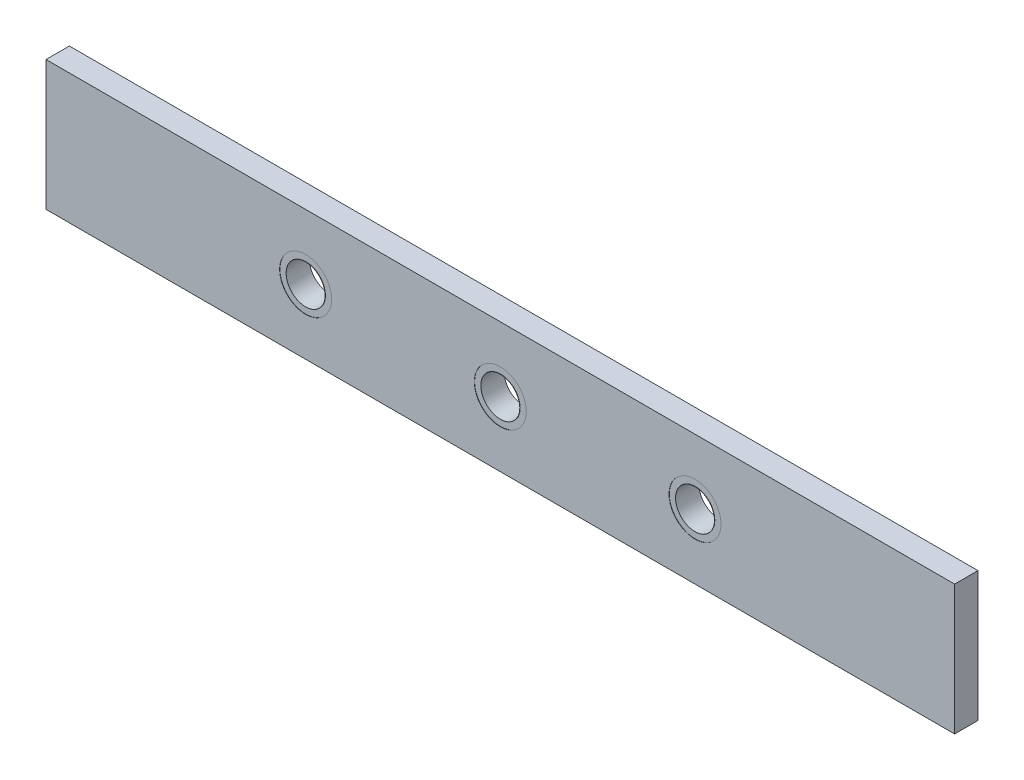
ISO-10303-21;
HEADER;
FILE_DESCRIPTION(('STEP AP214'),'2;1');
FILE_NAME('part.step','',(''),(''),'','','');
FILE_SCHEMA(('AUTOMOTIVE_DESIGN { 1 0 10303 214 1 1 1 1 }'));
ENDSEC;
DATA;
#1=APPLICATION_CONTEXT('core data for automotive mechanical design processes');
#2=APPLICATION_PROTOCOL_DEFINITION('international standard','automotive_design',2000,#1);
#3=PRODUCT_CONTEXT('',#1,'mechanical');
#4=PRODUCT('Part','Part','',(#3));
#5=PRODUCT_RELATED_PRODUCT_CATEGORY('part','',(#4));
#6=PRODUCT_DEFINITION_FORMATION('','',#4);
#7=PRODUCT_DEFINITION_CONTEXT('part definition',#1,'design');
#8=PRODUCT_DEFINITION('design','',#6,#7);
#9=PRODUCT_DEFINITION_SHAPE('','',#8);
#10=(LENGTH_UNIT() NAMED_UNIT(*) SI_UNIT(.MILLI.,.METRE.));
#11=(NAMED_UNIT(*) PLANE_ANGLE_UNIT() SI_UNIT($,.RADIAN.));
#12=(NAMED_UNIT(*) SI_UNIT($,.STERADIAN.) SOLID_ANGLE_UNIT());
#13=UNCERTAINTY_MEASURE_WITH_UNIT(LENGTH_MEASURE(1.E-05),#10,'distance_accuracy_value','');
#14=(GEOMETRIC_REPRESENTATION_CONTEXT(3) GLOBAL_UNCERTAINTY_ASSIGNED_CONTEXT((#13)) GLOBAL_UNIT_ASSIGNED_CONTEXT((#10,
#11,#12)) REPRESENTATION_CONTEXT('',''));
#15=CARTESIAN_POINT('',(0.,0.,0.));
#16=DIRECTION('',(0.,0.,1.));
#17=DIRECTION('',(1.,0.,0.));
#18=AXIS2_PLACEMENT_3D('',#15,#16,#17);
#19=CARTESIAN_POINT('',(0.,0.,0.));
#20=DIRECTION('',(0.,0.,1.));
#21=DIRECTION('',(1.,0.,0.));
#22=AXIS2_PLACEMENT_3D('',#19,#20,#21);
#23=PLANE('',#22);
#24=DIRECTION('',(0.,1.,0.));
#25=VECTOR('',#24,1.);
#26=CARTESIAN_POINT('',(350.,50.,0.));
#27=LINE('',#26,#25);
#28=CARTESIAN_POINT('',(350.,-50.,0.));
#29=VERTEX_POINT('',#28);
#30=CARTESIAN_POINT('',(350.,50.,0.));
#31=VERTEX_POINT('',#30);
#32=EDGE_CURVE('E96',#29,#31,#27,.T.);
#33=ORIENTED_EDGE('',*,*,#32,.F.);
#34=DIRECTION('',(1.,0.,0.));
#35=VECTOR('',#34,1.);
#36=CARTESIAN_POINT('',(-350.,-50.,0.));
#37=LINE('',#36,#35);
#38=CARTESIAN_POINT('',(-350.,-50.,0.));
#39=VERTEX_POINT('',#38);
#40=EDGE_CURVE('E72',#39,#29,#37,.T.);
#41=ORIENTED_EDGE('',*,*,#40,.F.);
#42=DIRECTION('',(0.,-1.,0.));
#43=VECTOR('',#42,1.);
#44=CARTESIAN_POINT('',(-350.,50.,0.));
#45=LINE('',#44,#43);
#46=CARTESIAN_POINT('',(-350.,50.,0.));
#47=VERTEX_POINT('',#46);
#48=EDGE_CURVE('E66',#47,#39,#45,.T.);
#49=ORIENTED_EDGE('',*,*,#48,.F.);
#50=DIRECTION('',(-1.,0.,0.));
#51=VECTOR('',#50,1.);
#52=CARTESIAN_POINT('',(-350.,50.,0.));
#53=LINE('',#52,#51);
#54=EDGE_CURVE('E88',#31,#47,#53,.T.);
#55=ORIENTED_EDGE('',*,*,#54,.F.);
#56=EDGE_LOOP('',(#33,#41,#49,#55));
#57=FACE_BOUND('',#56,.T.);
#58=CARTESIAN_POINT('',(150.,0.,0.));
#59=DIRECTION('',(0.,0.,1.));
#60=DIRECTION('',(1.,0.,0.));
#61=AXIS2_PLACEMENT_3D('',#58,#59,#60);
#62=CIRCLE('',#61,20.);
#63=CARTESIAN_POINT('',(170.,0.,0.));
#64=VERTEX_POINT('',#63);
#65=EDGE_CURVE('E164',#64,#64,#62,.T.);
#66=ORIENTED_EDGE('',*,*,#65,.T.);
#67=EDGE_LOOP('',(#66));
#68=FACE_BOUND('',#67,.T.);
#69=CARTESIAN_POINT('',(0.,0.,0.));
#70=DIRECTION('',(0.,0.,1.));
#71=DIRECTION('',(1.,0.,0.));
#72=AXIS2_PLACEMENT_3D('',#69,#70,#71);
#73=CIRCLE('',#72,20.);
#74=CARTESIAN_POINT('',(20.,0.,0.));
#75=VERTEX_POINT('',#74);
#76=EDGE_CURVE('E176',#75,#75,#73,.T.);
#77=ORIENTED_EDGE('',*,*,#76,.T.);
#78=EDGE_LOOP('',(#77));
#79=FACE_BOUND('',#78,.T.);
#80=CARTESIAN_POINT('',(-150.,0.,0.));
#81=DIRECTION('',(0.,0.,1.));
#82=DIRECTION('',(1.,0.,0.));
#83=AXIS2_PLACEMENT_3D('',#80,#81,#82);
#84=CIRCLE('',#83,20.);
#85=CARTESIAN_POINT('',(-130.,0.,0.));
#86=VERTEX_POINT('',#85);
#87=EDGE_CURVE('E188',#86,#86,#84,.T.);
#88=ORIENTED_EDGE('',*,*,#87,.T.);
#89=EDGE_LOOP('',(#88));
#90=FACE_BOUND('',#89,.T.);
#91=ADVANCED_FACE('F32',(#57,#68,#79,#90),#23,.F.);
#92=CARTESIAN_POINT('',(-150.,0.,0.));
#93=DIRECTION('',(0.,0.,1.));
#94=DIRECTION('',(1.,0.,0.));
#95=AXIS2_PLACEMENT_3D('',#92,#93,#94);
#96=CIRCLE('',#95,15.05);
#97=CARTESIAN_POINT('',(-134.95,0.,0.));
#98=VERTEX_POINT('',#97);
#99=EDGE_CURVE('E194',#98,#98,#96,.T.);
#100=ORIENTED_EDGE('',*,*,#99,.F.);
#101=EDGE_LOOP('',(#100));
#102=FACE_BOUND('',#101,.T.);
#103=CARTESIAN_POINT('',(-150.,0.,0.));
#104=DIRECTION('',(0.,0.,1.));
#105=DIRECTION('',(-1.,0.,0.));
#106=AXIS2_PLACEMENT_3D('',#103,#104,#105);
#107=CIRCLE('',#106,15.);
#108=CARTESIAN_POINT('',(-165.,0.,0.));
#109=VERTEX_POINT('',#108);
#110=EDGE_CURVE('E113',#109,#109,#107,.T.);
#111=ORIENTED_EDGE('',*,*,#110,.T.);
#112=EDGE_LOOP('',(#111));
#113=FACE_BOUND('',#112,.T.);
#114=ADVANCED_FACE('F209',(#102,#113),#23,.F.);
#115=CARTESIAN_POINT('',(0.,0.,0.));
#116=DIRECTION('',(0.,0.,1.));
#117=DIRECTION('',(1.,0.,0.));
#118=AXIS2_PLACEMENT_3D('',#115,#116,#117);
#119=CIRCLE('',#118,15.05);
#120=CARTESIAN_POINT('',(15.05,0.,0.));
#121=VERTEX_POINT('',#120);
#122=EDGE_CURVE('E182',#121,#121,#119,.T.);
#123=ORIENTED_EDGE('',*,*,#122,.F.);
#124=EDGE_LOOP('',(#123));
#125=FACE_BOUND('',#124,.T.);
#126=CARTESIAN_POINT('',(0.,0.,0.));
#127=DIRECTION('',(0.,0.,1.));
#128=DIRECTION('',(1.,0.,0.));
#129=AXIS2_PLACEMENT_3D('',#126,#127,#128);
#130=CIRCLE('',#129,15.);
#131=CARTESIAN_POINT('',(15.,0.,0.));
#132=VERTEX_POINT('',#131);
#133=EDGE_CURVE('E119',#132,#132,#130,.T.);
#134=ORIENTED_EDGE('',*,*,#133,.T.);
#135=EDGE_LOOP('',(#134));
#136=FACE_BOUND('',#135,.T.);
#137=ADVANCED_FACE('F212',(#125,#136),#23,.F.);
#138=CARTESIAN_POINT('',(0.,0.,18.));
#139=DIRECTION('',(0.,0.,1.));
#140=DIRECTION('',(1.,0.,0.));
#141=AXIS2_PLACEMENT_3D('',#138,#139,#140);
#142=PLANE('',#141);
#143=CARTESIAN_POINT('',(-150.,0.,18.));
#144=DIRECTION('',(0.,0.,1.));
#145=DIRECTION('',(-1.,0.,0.));
#146=AXIS2_PLACEMENT_3D('',#143,#144,#145);
#147=CIRCLE('',#146,15.);
#148=CARTESIAN_POINT('',(-165.,0.,18.));
#149=VERTEX_POINT('',#148);
#150=EDGE_CURVE('E116',#149,#149,#147,.T.);
#151=ORIENTED_EDGE('',*,*,#150,.F.);
#152=EDGE_LOOP('',(#151));
#153=FACE_BOUND('',#152,.T.);
#154=CARTESIAN_POINT('',(-150.,0.,18.));
#155=DIRECTION('',(0.,0.,1.));
#156=DIRECTION('',(1.,0.,0.));
#157=AXIS2_PLACEMENT_3D('',#154,#155,#156);
#158=CIRCLE('',#157,15.05);
#159=CARTESIAN_POINT('',(-134.95,0.,18.));
#160=VERTEX_POINT('',#159);
#161=EDGE_CURVE('E158',#160,#160,#158,.T.);
#162=ORIENTED_EDGE('',*,*,#161,.T.);
#163=EDGE_LOOP('',(#162));
#164=FACE_BOUND('',#163,.T.);
#165=ADVANCED_FACE('F224',(#153,#164),#142,.T.);
#166=CARTESIAN_POINT('',(0.,0.,18.));
#167=DIRECTION('',(0.,0.,1.));
#168=DIRECTION('',(1.,0.,0.));
#169=AXIS2_PLACEMENT_3D('',#166,#167,#168);
#170=CIRCLE('',#169,15.);
#171=CARTESIAN_POINT('',(15.,0.,18.));
#172=VERTEX_POINT('',#171);
#173=EDGE_CURVE('E122',#172,#172,#170,.T.);
#174=ORIENTED_EDGE('',*,*,#173,.F.);
#175=EDGE_LOOP('',(#174));
#176=FACE_BOUND('',#175,.T.);
#177=CARTESIAN_POINT('',(0.,0.,18.));
#178=DIRECTION('',(0.,0.,1.));
#179=DIRECTION('',(1.,0.,0.));
#180=AXIS2_PLACEMENT_3D('',#177,#178,#179);
#181=CIRCLE('',#180,15.05);
#182=CARTESIAN_POINT('',(15.05,0.,18.));
#183=VERTEX_POINT('',#182);
#184=EDGE_CURVE('E146',#183,#183,#181,.T.);
#185=ORIENTED_EDGE('',*,*,#184,.T.);
#186=EDGE_LOOP('',(#185));
#187=FACE_BOUND('',#186,.T.);
#188=ADVANCED_FACE('F227',(#176,#187),#142,.T.);
#189=CARTESIAN_POINT('',(150.,0.,18.));
#190=DIRECTION('',(0.,0.,1.));
#191=DIRECTION('',(1.,0.,0.));
#192=AXIS2_PLACEMENT_3D('',#189,#190,#191);
#193=CIRCLE('',#192,15.);
#194=CARTESIAN_POINT('',(165.,0.,18.));
#195=VERTEX_POINT('',#194);
#196=EDGE_CURVE('E110',#195,#195,#193,.T.);
#197=ORIENTED_EDGE('',*,*,#196,.F.);
#198=EDGE_LOOP('',(#197));
#199=FACE_BOUND('',#198,.T.);
#200=CARTESIAN_POINT('',(150.,0.,18.));
#201=DIRECTION('',(0.,0.,1.));
#202=DIRECTION('',(1.,0.,0.));
#203=AXIS2_PLACEMENT_3D('',#200,#201,#202);
#204=CIRCLE('',#203,15.05);
#205=CARTESIAN_POINT('',(165.05,0.,18.));
#206=VERTEX_POINT('',#205);
#207=EDGE_CURVE('E134',#206,#206,#204,.T.);
#208=ORIENTED_EDGE('',*,*,#207,.T.);
#209=EDGE_LOOP('',(#208));
#210=FACE_BOUND('',#209,.T.);
#211=ADVANCED_FACE('F262',(#199,#210),#142,.T.);
#212=CARTESIAN_POINT('',(350.,50.,18.));
#213=DIRECTION('',(-1.,0.,0.));
#214=DIRECTION('',(0.,0.,1.));
#215=AXIS2_PLACEMENT_3D('',#212,#213,#214);
#216=PLANE('',#215);
#217=ORIENTED_EDGE('',*,*,#32,.T.);
#218=DIRECTION('',(0.,0.,-1.));
#219=VECTOR('',#218,1.);
#220=CARTESIAN_POINT('',(350.,50.,18.));
#221=LINE('',#220,#219);
#222=CARTESIAN_POINT('',(350.,50.,18.));
#223=VERTEX_POINT('',#222);
#224=EDGE_CURVE('E11',#223,#31,#221,.T.);
#225=ORIENTED_EDGE('',*,*,#224,.F.);
#226=DIRECTION('',(0.,1.,0.));
#227=VECTOR('',#226,1.);
#228=CARTESIAN_POINT('',(350.,50.,18.));
#229=LINE('',#228,#227);
#230=CARTESIAN_POINT('',(350.,-50.,18.));
#231=VERTEX_POINT('',#230);
#232=EDGE_CURVE('E84',#231,#223,#229,.T.);
#233=ORIENTED_EDGE('',*,*,#232,.F.);
#234=DIRECTION('',(0.,0.,-1.));
#235=VECTOR('',#234,1.);
#236=CARTESIAN_POINT('',(350.,-50.,18.));
#237=LINE('',#236,#235);
#238=EDGE_CURVE('E92',#231,#29,#237,.T.);
#239=ORIENTED_EDGE('',*,*,#238,.T.);
#240=EDGE_LOOP('',(#217,#225,#233,#239));
#241=FACE_BOUND('',#240,.T.);
#242=ADVANCED_FACE('F34',(#241),#216,.F.);
#243=CARTESIAN_POINT('',(-350.,50.,18.));
#244=DIRECTION('',(0.,-1.,0.));
#245=DIRECTION('',(0.,0.,-1.));
#246=AXIS2_PLACEMENT_3D('',#243,#244,#245);
#247=PLANE('',#246);
#248=ORIENTED_EDGE('',*,*,#54,.T.);
#249=DIRECTION('',(0.,0.,-1.));
#250=VECTOR('',#249,1.);
#251=CARTESIAN_POINT('',(-350.,50.,18.));
#252=LINE('',#251,#250);
#253=CARTESIAN_POINT('',(-350.,50.,18.));
#254=VERTEX_POINT('',#253);
#255=EDGE_CURVE('E41',#254,#47,#252,.T.);
#256=ORIENTED_EDGE('',*,*,#255,.F.);
#257=DIRECTION('',(-1.,0.,0.));
#258=VECTOR('',#257,1.);
#259=CARTESIAN_POINT('',(-350.,50.,18.));
#260=LINE('',#259,#258);
#261=EDGE_CURVE('E79',#223,#254,#260,.T.);
#262=ORIENTED_EDGE('',*,*,#261,.F.);
#263=ORIENTED_EDGE('',*,*,#224,.T.);
#264=EDGE_LOOP('',(#248,#256,#262,#263));
#265=FACE_BOUND('',#264,.T.);
#266=ADVANCED_FACE('F87',(#265),#247,.F.);
#267=CARTESIAN_POINT('',(-350.,50.,18.));
#268=DIRECTION('',(1.,0.,0.));
#269=DIRECTION('',(0.,0.,-1.));
#270=AXIS2_PLACEMENT_3D('',#267,#268,#269);
#271=PLANE('',#270);
#272=ORIENTED_EDGE('',*,*,#48,.T.);
#273=DIRECTION('',(0.,0.,-1.));
#274=VECTOR('',#273,1.);
#275=CARTESIAN_POINT('',(-350.,-50.,18.));
#276=LINE('',#275,#274);
#277=CARTESIAN_POINT('',(-350.,-50.,18.));
#278=VERTEX_POINT('',#277);
#279=EDGE_CURVE('E89',#278,#39,#276,.T.);
#280=ORIENTED_EDGE('',*,*,#279,.F.);
#281=DIRECTION('',(0.,-1.,0.));
#282=VECTOR('',#281,1.);
#283=CARTESIAN_POINT('',(-350.,50.,18.));
#284=LINE('',#283,#282);
#285=EDGE_CURVE('E82',#254,#278,#284,.T.);
#286=ORIENTED_EDGE('',*,*,#285,.F.);
#287=ORIENTED_EDGE('',*,*,#255,.T.);
#288=EDGE_LOOP('',(#272,#280,#286,#287));
#289=FACE_BOUND('',#288,.T.);
#290=ADVANCED_FACE('F90',(#289),#271,.F.);
#291=CARTESIAN_POINT('',(-350.,-50.,18.));
#292=DIRECTION('',(0.,1.,0.));
#293=DIRECTION('',(0.,0.,1.));
#294=AXIS2_PLACEMENT_3D('',#291,#292,#293);
#295=PLANE('',#294);
#296=ORIENTED_EDGE('',*,*,#40,.T.);
#297=ORIENTED_EDGE('',*,*,#238,.F.);
#298=DIRECTION('',(1.,0.,0.));
#299=VECTOR('',#298,1.);
#300=CARTESIAN_POINT('',(-350.,-50.,18.));
#301=LINE('',#300,#299);
#302=EDGE_CURVE('E49',#278,#231,#301,.T.);
#303=ORIENTED_EDGE('',*,*,#302,.F.);
#304=ORIENTED_EDGE('',*,*,#279,.T.);
#305=EDGE_LOOP('',(#296,#297,#303,#304));
#306=FACE_BOUND('',#305,.T.);
#307=ADVANCED_FACE('F104',(#306),#295,.F.);
#308=CARTESIAN_POINT('',(-150.,0.,18.));
#309=DIRECTION('',(0.,0.,1.));
#310=DIRECTION('',(1.,0.,0.));
#311=AXIS2_PLACEMENT_3D('',#308,#309,#310);
#312=CIRCLE('',#311,20.);
#313=CARTESIAN_POINT('',(-130.,0.,18.));
#314=VERTEX_POINT('',#313);
#315=EDGE_CURVE('E152',#314,#314,#312,.T.);
#316=ORIENTED_EDGE('',*,*,#315,.F.);
#317=EDGE_LOOP('',(#316));
#318=FACE_BOUND('',#317,.T.);
#319=CARTESIAN_POINT('',(0.,0.,18.));
#320=DIRECTION('',(0.,0.,1.));
#321=DIRECTION('',(1.,0.,0.));
#322=AXIS2_PLACEMENT_3D('',#319,#320,#321);
#323=CIRCLE('',#322,20.);
#324=CARTESIAN_POINT('',(20.,0.,18.));
#325=VERTEX_POINT('',#324);
#326=EDGE_CURVE('E140',#325,#325,#323,.T.);
#327=ORIENTED_EDGE('',*,*,#326,.F.);
#328=EDGE_LOOP('',(#327));
#329=FACE_BOUND('',#328,.T.);
#330=CARTESIAN_POINT('',(150.,0.,18.));
#331=DIRECTION('',(0.,0.,1.));
#332=DIRECTION('',(1.,0.,0.));
#333=AXIS2_PLACEMENT_3D('',#330,#331,#332);
#334=CIRCLE('',#333,20.);
#335=CARTESIAN_POINT('',(170.,0.,18.));
#336=VERTEX_POINT('',#335);
#337=EDGE_CURVE('E128',#336,#336,#334,.T.);
#338=ORIENTED_EDGE('',*,*,#337,.F.);
#339=EDGE_LOOP('',(#338));
#340=FACE_BOUND('',#339,.T.);
#341=ORIENTED_EDGE('',*,*,#232,.T.);
#342=ORIENTED_EDGE('',*,*,#261,.T.);
#343=ORIENTED_EDGE('',*,*,#285,.T.);
#344=ORIENTED_EDGE('',*,*,#302,.T.);
#345=EDGE_LOOP('',(#341,#342,#343,#344));
#346=FACE_BOUND('',#345,.T.);
#347=ADVANCED_FACE('F80',(#318,#329,#340,#346),#142,.T.);
#348=CARTESIAN_POINT('',(150.,0.,0.));
#349=DIRECTION('',(0.,0.,1.));
#350=DIRECTION('',(1.,0.,0.));
#351=AXIS2_PLACEMENT_3D('',#348,#349,#350);
#352=CIRCLE('',#351,15.05);
#353=CARTESIAN_POINT('',(165.05,0.,0.));
#354=VERTEX_POINT('',#353);
#355=EDGE_CURVE('E170',#354,#354,#352,.T.);
#356=ORIENTED_EDGE('',*,*,#355,.F.);
#357=EDGE_LOOP('',(#356));
#358=FACE_BOUND('',#357,.T.);
#359=CARTESIAN_POINT('',(150.,0.,0.));
#360=DIRECTION('',(0.,0.,1.));
#361=DIRECTION('',(1.,0.,0.));
#362=AXIS2_PLACEMENT_3D('',#359,#360,#361);
#363=CIRCLE('',#362,15.);
#364=CARTESIAN_POINT('',(165.,0.,0.));
#365=VERTEX_POINT('',#364);
#366=EDGE_CURVE('E99',#365,#365,#363,.T.);
#367=ORIENTED_EDGE('',*,*,#366,.T.);
#368=EDGE_LOOP('',(#367));
#369=FACE_BOUND('',#368,.T.);
#370=ADVANCED_FACE('F249',(#358,#369),#23,.F.);
#371=CARTESIAN_POINT('',(150.,0.,0.));
#372=DIRECTION('',(0.,0.,1.));
#373=DIRECTION('',(1.,0.,0.));
#374=AXIS2_PLACEMENT_3D('',#371,#372,#373);
#375=CYLINDRICAL_SURFACE('',#374,15.);
#376=ORIENTED_EDGE('',*,*,#366,.F.);
#377=EDGE_LOOP('',(#376));
#378=FACE_BOUND('',#377,.T.);
#379=ORIENTED_EDGE('',*,*,#196,.T.);
#380=EDGE_LOOP('',(#379));
#381=FACE_BOUND('',#380,.T.);
#382=ADVANCED_FACE('F220',(#378,#381),#375,.F.);
#383=CARTESIAN_POINT('',(-150.,0.,0.));
#384=DIRECTION('',(0.,0.,1.));
#385=DIRECTION('',(1.,0.,0.));
#386=AXIS2_PLACEMENT_3D('',#383,#384,#385);
#387=CYLINDRICAL_SURFACE('',#386,15.);
#388=ORIENTED_EDGE('',*,*,#110,.F.);
#389=EDGE_LOOP('',(#388));
#390=FACE_BOUND('',#389,.T.);
#391=ORIENTED_EDGE('',*,*,#150,.T.);
#392=EDGE_LOOP('',(#391));
#393=FACE_BOUND('',#392,.T.);
#394=ADVANCED_FACE('F216',(#390,#393),#387,.F.);
#395=CARTESIAN_POINT('',(0.,0.,0.));
#396=DIRECTION('',(0.,0.,1.));
#397=DIRECTION('',(1.,0.,0.));
#398=AXIS2_PLACEMENT_3D('',#395,#396,#397);
#399=CYLINDRICAL_SURFACE('',#398,15.);
#400=ORIENTED_EDGE('',*,*,#133,.F.);
#401=EDGE_LOOP('',(#400));
#402=FACE_BOUND('',#401,.T.);
#403=ORIENTED_EDGE('',*,*,#173,.T.);
#404=EDGE_LOOP('',(#403));
#405=FACE_BOUND('',#404,.T.);
#406=ADVANCED_FACE('F219',(#402,#405),#399,.F.);
#407=CARTESIAN_POINT('',(150.,0.,17.8));
#408=DIRECTION('',(0.,0.,1.));
#409=DIRECTION('',(1.,0.,0.));
#410=AXIS2_PLACEMENT_3D('',#407,#408,#409);
#411=CYLINDRICAL_SURFACE('',#410,20.);
#412=CARTESIAN_POINT('',(150.,0.,17.8));
#413=DIRECTION('',(0.,0.,1.));
#414=DIRECTION('',(1.,0.,0.));
#415=AXIS2_PLACEMENT_3D('',#412,#413,#414);
#416=CIRCLE('',#415,20.);
#417=CARTESIAN_POINT('',(170.,0.,17.8));
#418=VERTEX_POINT('',#417);
#419=EDGE_CURVE('E125',#418,#418,#416,.T.);
#420=ORIENTED_EDGE('',*,*,#419,.F.);
#421=EDGE_LOOP('',(#420));
#422=FACE_BOUND('',#421,.T.);
#423=ORIENTED_EDGE('',*,*,#337,.T.);
#424=EDGE_LOOP('',(#423));
#425=FACE_BOUND('',#424,.T.);
#426=ADVANCED_FACE('F275',(#422,#425),#411,.F.);
#427=CARTESIAN_POINT('',(150.,0.,17.8));
#428=DIRECTION('',(0.,0.,1.));
#429=DIRECTION('',(1.,0.,0.));
#430=AXIS2_PLACEMENT_3D('',#427,#428,#429);
#431=PLANE('',#430);
#432=CARTESIAN_POINT('',(150.,0.,17.8));
#433=DIRECTION('',(0.,0.,1.));
#434=DIRECTION('',(1.,0.,0.));
#435=AXIS2_PLACEMENT_3D('',#432,#433,#434);
#436=CIRCLE('',#435,15.05);
#437=CARTESIAN_POINT('',(165.05,0.,17.8));
#438=VERTEX_POINT('',#437);
#439=EDGE_CURVE('E131',#438,#438,#436,.T.);
#440=ORIENTED_EDGE('',*,*,#439,.F.);
#441=EDGE_LOOP('',(#440));
#442=FACE_BOUND('',#441,.T.);
#443=ORIENTED_EDGE('',*,*,#419,.T.);
#444=EDGE_LOOP('',(#443));
#445=FACE_BOUND('',#444,.T.);
#446=ADVANCED_FACE('F304',(#442,#445),#431,.T.);
#447=CARTESIAN_POINT('',(150.,0.,17.8));
#448=DIRECTION('',(0.,0.,1.));
#449=DIRECTION('',(1.,0.,0.));
#450=AXIS2_PLACEMENT_3D('',#447,#448,#449);
#451=CYLINDRICAL_SURFACE('',#450,15.05);
#452=ORIENTED_EDGE('',*,*,#439,.T.);
#453=EDGE_LOOP('',(#452));
#454=FACE_BOUND('',#453,.T.);
#455=ORIENTED_EDGE('',*,*,#207,.F.);
#456=EDGE_LOOP('',(#455));
#457=FACE_BOUND('',#456,.T.);
#458=ADVANCED_FACE('F300',(#454,#457),#451,.T.);
#459=CARTESIAN_POINT('',(0.,0.,17.8));
#460=DIRECTION('',(0.,0.,1.));
#461=DIRECTION('',(1.,0.,0.));
#462=AXIS2_PLACEMENT_3D('',#459,#460,#461);
#463=CYLINDRICAL_SURFACE('',#462,20.);
#464=CARTESIAN_POINT('',(0.,0.,17.8));
#465=DIRECTION('',(0.,0.,1.));
#466=DIRECTION('',(1.,0.,0.));
#467=AXIS2_PLACEMENT_3D('',#464,#465,#466);
#468=CIRCLE('',#467,20.);
#469=CARTESIAN_POINT('',(20.,0.,17.8));
#470=VERTEX_POINT('',#469);
#471=EDGE_CURVE('E137',#470,#470,#468,.T.);
#472=ORIENTED_EDGE('',*,*,#471,.F.);
#473=EDGE_LOOP('',(#472));
#474=FACE_BOUND('',#473,.T.);
#475=ORIENTED_EDGE('',*,*,#326,.T.);
#476=EDGE_LOOP('',(#475));
#477=FACE_BOUND('',#476,.T.);
#478=ADVANCED_FACE('F294',(#474,#477),#463,.F.);
#479=CARTESIAN_POINT('',(0.,0.,17.8));
#480=DIRECTION('',(0.,0.,1.));
#481=DIRECTION('',(1.,0.,0.));
#482=AXIS2_PLACEMENT_3D('',#479,#480,#481);
#483=PLANE('',#482);
#484=CARTESIAN_POINT('',(0.,0.,17.8));
#485=DIRECTION('',(0.,0.,1.));
#486=DIRECTION('',(1.,0.,0.));
#487=AXIS2_PLACEMENT_3D('',#484,#485,#486);
#488=CIRCLE('',#487,15.05);
#489=CARTESIAN_POINT('',(15.05,0.,17.8));
#490=VERTEX_POINT('',#489);
#491=EDGE_CURVE('E143',#490,#490,#488,.T.);
#492=ORIENTED_EDGE('',*,*,#491,.F.);
#493=EDGE_LOOP('',(#492));
#494=FACE_BOUND('',#493,.T.);
#495=ORIENTED_EDGE('',*,*,#471,.T.);
#496=EDGE_LOOP('',(#495));
#497=FACE_BOUND('',#496,.T.);
#498=ADVANCED_FACE('F285',(#494,#497),#483,.T.);
#499=CARTESIAN_POINT('',(0.,0.,17.8));
#500=DIRECTION('',(0.,0.,1.));
#501=DIRECTION('',(1.,0.,0.));
#502=AXIS2_PLACEMENT_3D('',#499,#500,#501);
#503=CYLINDRICAL_SURFACE('',#502,15.05);
#504=ORIENTED_EDGE('',*,*,#491,.T.);
#505=EDGE_LOOP('',(#504));
#506=FACE_BOUND('',#505,.T.);
#507=ORIENTED_EDGE('',*,*,#184,.F.);
#508=EDGE_LOOP('',(#507));
#509=FACE_BOUND('',#508,.T.);
#510=ADVANCED_FACE('F283',(#506,#509),#503,.T.);
#511=CARTESIAN_POINT('',(-150.,0.,17.8));
#512=DIRECTION('',(0.,0.,1.));
#513=DIRECTION('',(1.,0.,0.));
#514=AXIS2_PLACEMENT_3D('',#511,#512,#513);
#515=CYLINDRICAL_SURFACE('',#514,20.);
#516=CARTESIAN_POINT('',(-150.,0.,17.8));
#517=DIRECTION('',(0.,0.,1.));
#518=DIRECTION('',(1.,0.,0.));
#519=AXIS2_PLACEMENT_3D('',#516,#517,#518);
#520=CIRCLE('',#519,20.);
#521=CARTESIAN_POINT('',(-130.,0.,17.8));
#522=VERTEX_POINT('',#521);
#523=EDGE_CURVE('E149',#522,#522,#520,.T.);
#524=ORIENTED_EDGE('',*,*,#523,.F.);
#525=EDGE_LOOP('',(#524));
#526=FACE_BOUND('',#525,.T.);
#527=ORIENTED_EDGE('',*,*,#315,.T.);
#528=EDGE_LOOP('',(#527));
#529=FACE_BOUND('',#528,.T.);
#530=ADVANCED_FACE('F244',(#526,#529),#515,.F.);
#531=CARTESIAN_POINT('',(-150.,0.,17.8));
#532=DIRECTION('',(0.,0.,1.));
#533=DIRECTION('',(1.,0.,0.));
#534=AXIS2_PLACEMENT_3D('',#531,#532,#533);
#535=PLANE('',#534);
#536=CARTESIAN_POINT('',(-150.,0.,17.8));
#537=DIRECTION('',(0.,0.,1.));
#538=DIRECTION('',(1.,0.,0.));
#539=AXIS2_PLACEMENT_3D('',#536,#537,#538);
#540=CIRCLE('',#539,15.05);
#541=CARTESIAN_POINT('',(-134.95,0.,17.8));
#542=VERTEX_POINT('',#541);
#543=EDGE_CURVE('E155',#542,#542,#540,.T.);
#544=ORIENTED_EDGE('',*,*,#543,.F.);
#545=EDGE_LOOP('',(#544));
#546=FACE_BOUND('',#545,.T.);
#547=ORIENTED_EDGE('',*,*,#523,.T.);
#548=EDGE_LOOP('',(#547));
#549=FACE_BOUND('',#548,.T.);
#550=ADVANCED_FACE('F234',(#546,#549),#535,.T.);
#551=CARTESIAN_POINT('',(-150.,0.,17.8));
#552=DIRECTION('',(0.,0.,1.));
#553=DIRECTION('',(1.,0.,0.));
#554=AXIS2_PLACEMENT_3D('',#551,#552,#553);
#555=CYLINDRICAL_SURFACE('',#554,15.05);
#556=ORIENTED_EDGE('',*,*,#543,.T.);
#557=EDGE_LOOP('',(#556));
#558=FACE_BOUND('',#557,.T.);
#559=ORIENTED_EDGE('',*,*,#161,.F.);
#560=EDGE_LOOP('',(#559));
#561=FACE_BOUND('',#560,.T.);
#562=ADVANCED_FACE('F231',(#558,#561),#555,.T.);
#563=CARTESIAN_POINT('',(150.,0.,0.2));
#564=DIRECTION('',(0.,0.,-1.));
#565=DIRECTION('',(1.,0.,0.));
#566=AXIS2_PLACEMENT_3D('',#563,#564,#565);
#567=PLANE('',#566);
#568=CARTESIAN_POINT('',(150.,0.,0.2));
#569=DIRECTION('',(0.,0.,1.));
#570=DIRECTION('',(1.,0.,0.));
#571=AXIS2_PLACEMENT_3D('',#568,#569,#570);
#572=CIRCLE('',#571,20.);
#573=CARTESIAN_POINT('',(170.,0.,0.2));
#574=VERTEX_POINT('',#573);
#575=EDGE_CURVE('E161',#574,#574,#572,.T.);
#576=ORIENTED_EDGE('',*,*,#575,.F.);
#577=EDGE_LOOP('',(#576));
#578=FACE_BOUND('',#577,.T.);
#579=CARTESIAN_POINT('',(150.,0.,0.2));
#580=DIRECTION('',(0.,0.,1.));
#581=DIRECTION('',(1.,0.,0.));
#582=AXIS2_PLACEMENT_3D('',#579,#580,#581);
#583=CIRCLE('',#582,15.05);
#584=CARTESIAN_POINT('',(165.05,0.,0.2));
#585=VERTEX_POINT('',#584);
#586=EDGE_CURVE('E167',#585,#585,#583,.T.);
#587=ORIENTED_EDGE('',*,*,#586,.T.);
#588=EDGE_LOOP('',(#587));
#589=FACE_BOUND('',#588,.T.);
#590=ADVANCED_FACE('F233',(#578,#589),#567,.T.);
#591=CARTESIAN_POINT('',(150.,0.,0.2));
#592=DIRECTION('',(0.,0.,-1.));
#593=DIRECTION('',(-1.,0.,0.));
#594=AXIS2_PLACEMENT_3D('',#591,#592,#593);
#595=CYLINDRICAL_SURFACE('',#594,20.);
#596=ORIENTED_EDGE('',*,*,#575,.T.);
#597=EDGE_LOOP('',(#596));
#598=FACE_BOUND('',#597,.T.);
#599=ORIENTED_EDGE('',*,*,#65,.F.);
#600=EDGE_LOOP('',(#599));
#601=FACE_BOUND('',#600,.T.);
#602=ADVANCED_FACE('F241',(#598,#601),#595,.F.);
#603=CARTESIAN_POINT('',(150.,0.,0.2));
#604=DIRECTION('',(0.,0.,-1.));
#605=DIRECTION('',(-1.,0.,0.));
#606=AXIS2_PLACEMENT_3D('',#603,#604,#605);
#607=CYLINDRICAL_SURFACE('',#606,15.05);
#608=ORIENTED_EDGE('',*,*,#586,.F.);
#609=EDGE_LOOP('',(#608));
#610=FACE_BOUND('',#609,.T.);
#611=ORIENTED_EDGE('',*,*,#355,.T.);
#612=EDGE_LOOP('',(#611));
#613=FACE_BOUND('',#612,.T.);
#614=ADVANCED_FACE('F392',(#610,#613),#607,.T.);
#615=CARTESIAN_POINT('',(0.,0.,0.2));
#616=DIRECTION('',(0.,0.,-1.));
#617=DIRECTION('',(1.,0.,0.));
#618=AXIS2_PLACEMENT_3D('',#615,#616,#617);
#619=PLANE('',#618);
#620=CARTESIAN_POINT('',(0.,0.,0.2));
#621=DIRECTION('',(0.,0.,1.));
#622=DIRECTION('',(1.,0.,0.));
#623=AXIS2_PLACEMENT_3D('',#620,#621,#622);
#624=CIRCLE('',#623,20.);
#625=CARTESIAN_POINT('',(20.,0.,0.2));
#626=VERTEX_POINT('',#625);
#627=EDGE_CURVE('E173',#626,#626,#624,.T.);
#628=ORIENTED_EDGE('',*,*,#627,.F.);
#629=EDGE_LOOP('',(#628));
#630=FACE_BOUND('',#629,.T.);
#631=CARTESIAN_POINT('',(0.,0.,0.2));
#632=DIRECTION('',(0.,0.,1.));
#633=DIRECTION('',(1.,0.,0.));
#634=AXIS2_PLACEMENT_3D('',#631,#632,#633);
#635=CIRCLE('',#634,15.05);
#636=CARTESIAN_POINT('',(15.05,0.,0.2));
#637=VERTEX_POINT('',#636);
#638=EDGE_CURVE('E179',#637,#637,#635,.T.);
#639=ORIENTED_EDGE('',*,*,#638,.T.);
#640=EDGE_LOOP('',(#639));
#641=FACE_BOUND('',#640,.T.);
#642=ADVANCED_FACE('F401',(#630,#641),#619,.T.);
#643=CARTESIAN_POINT('',(0.,0.,0.2));
#644=DIRECTION('',(0.,0.,-1.));
#645=DIRECTION('',(-1.,0.,0.));
#646=AXIS2_PLACEMENT_3D('',#643,#644,#645);
#647=CYLINDRICAL_SURFACE('',#646,20.);
#648=ORIENTED_EDGE('',*,*,#627,.T.);
#649=EDGE_LOOP('',(#648));
#650=FACE_BOUND('',#649,.T.);
#651=ORIENTED_EDGE('',*,*,#76,.F.);
#652=EDGE_LOOP('',(#651));
#653=FACE_BOUND('',#652,.T.);
#654=ADVANCED_FACE('F411',(#650,#653),#647,.F.);
#655=CARTESIAN_POINT('',(0.,0.,0.2));
#656=DIRECTION('',(0.,0.,-1.));
#657=DIRECTION('',(-1.,0.,0.));
#658=AXIS2_PLACEMENT_3D('',#655,#656,#657);
#659=CYLINDRICAL_SURFACE('',#658,15.05);
#660=ORIENTED_EDGE('',*,*,#638,.F.);
#661=EDGE_LOOP('',(#660));
#662=FACE_BOUND('',#661,.T.);
#663=ORIENTED_EDGE('',*,*,#122,.T.);
#664=EDGE_LOOP('',(#663));
#665=FACE_BOUND('',#664,.T.);
#666=ADVANCED_FACE('F421',(#662,#665),#659,.T.);
#667=CARTESIAN_POINT('',(-150.,0.,0.2));
#668=DIRECTION('',(0.,0.,-1.));
#669=DIRECTION('',(1.,0.,0.));
#670=AXIS2_PLACEMENT_3D('',#667,#668,#669);
#671=PLANE('',#670);
#672=CARTESIAN_POINT('',(-150.,0.,0.2));
#673=DIRECTION('',(0.,0.,1.));
#674=DIRECTION('',(1.,0.,0.));
#675=AXIS2_PLACEMENT_3D('',#672,#673,#674);
#676=CIRCLE('',#675,20.);
#677=CARTESIAN_POINT('',(-130.,0.,0.2));
#678=VERTEX_POINT('',#677);
#679=EDGE_CURVE('E185',#678,#678,#676,.T.);
#680=ORIENTED_EDGE('',*,*,#679,.F.);
#681=EDGE_LOOP('',(#680));
#682=FACE_BOUND('',#681,.T.);
#683=CARTESIAN_POINT('',(-150.,0.,0.2));
#684=DIRECTION('',(0.,0.,1.));
#685=DIRECTION('',(1.,0.,0.));
#686=AXIS2_PLACEMENT_3D('',#683,#684,#685);
#687=CIRCLE('',#686,15.05);
#688=CARTESIAN_POINT('',(-134.95,0.,0.2));
#689=VERTEX_POINT('',#688);
#690=EDGE_CURVE('E191',#689,#689,#687,.T.);
#691=ORIENTED_EDGE('',*,*,#690,.T.);
#692=EDGE_LOOP('',(#691));
#693=FACE_BOUND('',#692,.T.);
#694=ADVANCED_FACE('F200',(#682,#693),#671,.T.);
#695=CARTESIAN_POINT('',(-150.,0.,0.2));
#696=DIRECTION('',(0.,0.,-1.));
#697=DIRECTION('',(-1.,0.,0.));
#698=AXIS2_PLACEMENT_3D('',#695,#696,#697);
#699=CYLINDRICAL_SURFACE('',#698,20.);
#700=ORIENTED_EDGE('',*,*,#679,.T.);
#701=EDGE_LOOP('',(#700));
#702=FACE_BOUND('',#701,.T.);
#703=ORIENTED_EDGE('',*,*,#87,.F.);
#704=EDGE_LOOP('',(#703));
#705=FACE_BOUND('',#704,.T.);
#706=ADVANCED_FACE('F205',(#702,#705),#699,.F.);
#707=CARTESIAN_POINT('',(-150.,0.,0.2));
#708=DIRECTION('',(0.,0.,-1.));
#709=DIRECTION('',(-1.,0.,0.));
#710=AXIS2_PLACEMENT_3D('',#707,#708,#709);
#711=CYLINDRICAL_SURFACE('',#710,15.05);
#712=ORIENTED_EDGE('',*,*,#690,.F.);
#713=EDGE_LOOP('',(#712));
#714=FACE_BOUND('',#713,.T.);
#715=ORIENTED_EDGE('',*,*,#99,.T.);
#716=EDGE_LOOP('',(#715));
#717=FACE_BOUND('',#716,.T.);
#718=ADVANCED_FACE('F202',(#714,#717),#711,.T.);
#719=CLOSED_SHELL('',(#91,#114,#137,#165,#188,#211,#242,#266,#290,#307,#347,#370,#382,#394,#406,
#426,#446,#458,#478,#498,#510,#530,#550,#562,#590,#602,#614,#642,#654,#666,#694,#706,#718));
#720=MANIFOLD_SOLID_BREP('B2',#719);
#721=ADVANCED_BREP_SHAPE_REPRESENTATION('',(#18,#720),#14);
#722=SHAPE_DEFINITION_REPRESENTATION(#9,#721);
ENDSEC;
END-ISO-10303-21;
